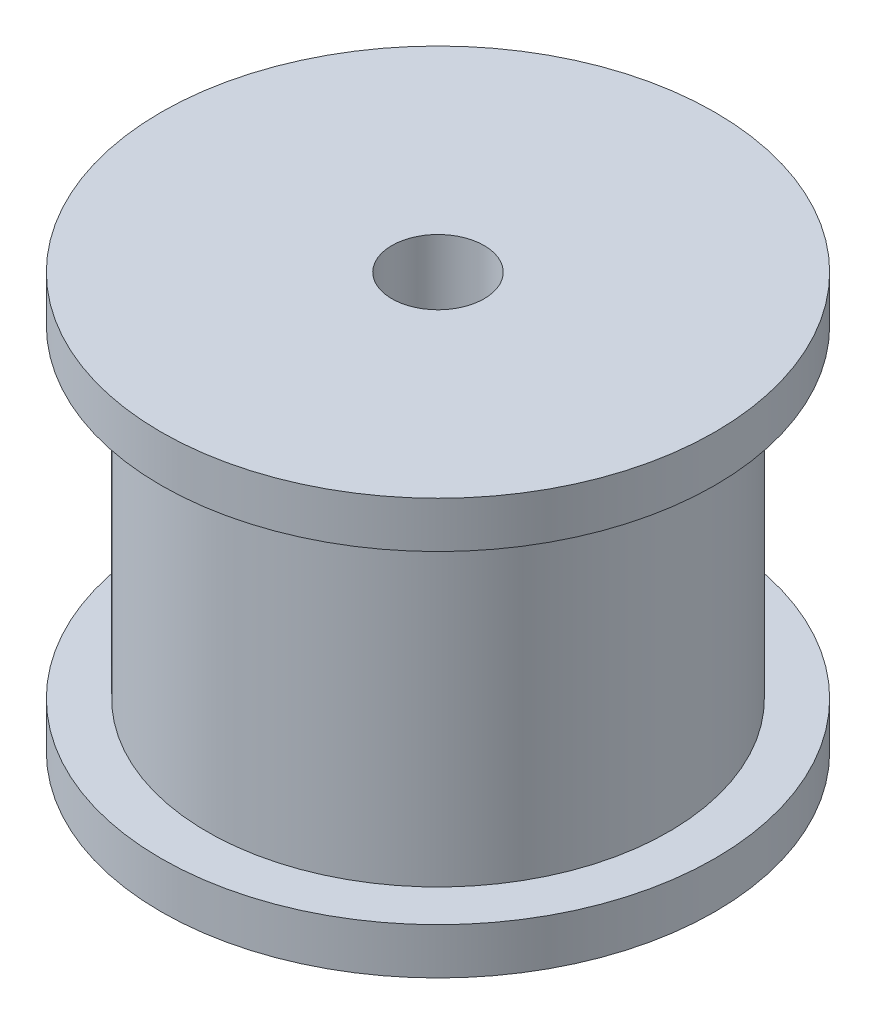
from build123d import *


with BuildPart() as part:
    # Sketch1 → Revolve1 (revolve)
    with BuildSketch(Plane.XY, mode=Mode.PRIVATE) as revolve1_sk:
        Polygon((1, 0), (1, 9), (6, 9), (6, 8), (5, 8), (5, 1), (6, 1), (6, 0), align=None)
    revolve(revolve1_sk.sketch.rotate(Axis((0, 0, 0), (0, 1, 0)), 90), axis=Axis((0, 0, 0), (0, 1, 0)))


solid = part.part
